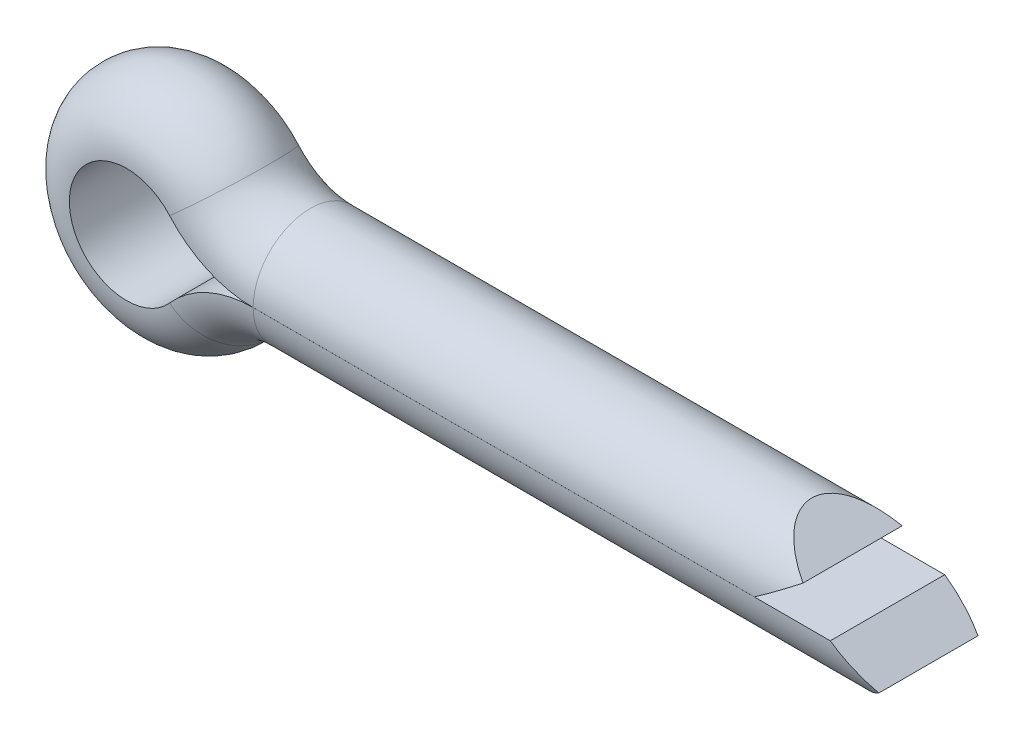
from build123d import *

# Parameters (mm, degrees)
CONECUT_DEPTH      = 53.387999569
CONECUT_DEPTH_BACK = 53.387999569


with BuildPart() as part:
    # Body: sweep along a path in PathSke
    with BuildLine(Plane.XY) as body_path:
        Line((45, 4.75), (0, 4.75))
        ThreePointArc((0, 4.75), (-1.846620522, 5.148259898), (-3.364941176, 6.272235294))
        ThreePointArc((-3.364941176, 6.272235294), (-20, 0), (-3.364941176, -6.272235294))
        ThreePointArc((-3.364941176, -6.272235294), (-1.846620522, -5.148259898), (0, -4.75))
        Line((0, -4.75), (51.3, -4.75))
    # SectionSke → Body (sweep)
    with BuildSketch(Plane(origin=(45, 0, 0), x_dir=(0, 0, -1), z_dir=(1, 0, 0))):
        with BuildLine():
            Line((-4.749999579, 0.002), (4.749999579, 0.002))
            ThreePointArc((4.749999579, 0.002), (0, 4.75), (-4.749999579, 0.002))
        make_face()
    sweep(path=body_path.line)

    # ConeCutSke → ConeCut (cut, two sides: drawn at the far end of the back side and taken through both)
    with BuildSketch(Plane.XY.offset(-CONECUT_DEPTH_BACK)):
        Polygon((45, 2.376), (41.603808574, 4.76), (51.31, 4.76), (51.31, -4.76), (47.903808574, -4.76), (51.3, -2.376), (47.898206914, 0), (41.598206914, 0), align=None)
    extrude(amount=CONECUT_DEPTH + CONECUT_DEPTH_BACK, mode=Mode.SUBTRACT)


solid = part.part
